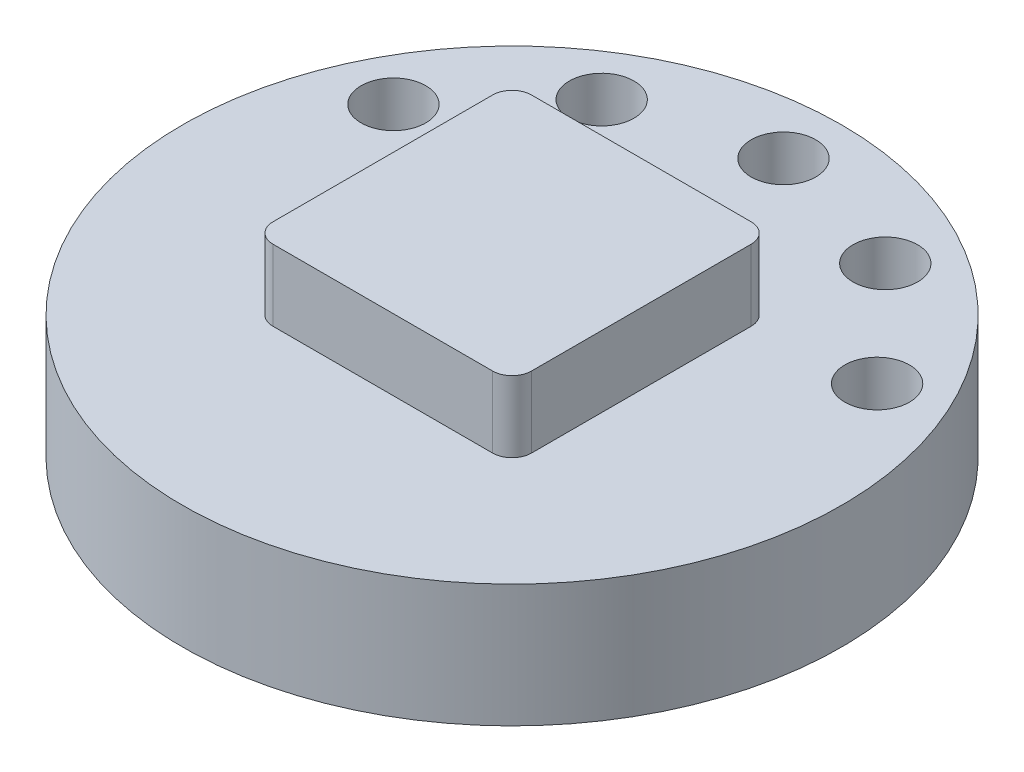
ISO-10303-21;
HEADER;
FILE_DESCRIPTION(('STEP AP214'),'2;1');
FILE_NAME('part.step','',(''),(''),'','','');
FILE_SCHEMA(('AUTOMOTIVE_DESIGN { 1 0 10303 214 1 1 1 1 }'));
ENDSEC;
DATA;
#1=APPLICATION_CONTEXT('core data for automotive mechanical design processes');
#2=APPLICATION_PROTOCOL_DEFINITION('international standard','automotive_design',2000,#1);
#3=PRODUCT_CONTEXT('',#1,'mechanical');
#4=PRODUCT('Part','Part','',(#3));
#5=PRODUCT_RELATED_PRODUCT_CATEGORY('part','',(#4));
#6=PRODUCT_DEFINITION_FORMATION('','',#4);
#7=PRODUCT_DEFINITION_CONTEXT('part definition',#1,'design');
#8=PRODUCT_DEFINITION('design','',#6,#7);
#9=PRODUCT_DEFINITION_SHAPE('','',#8);
#10=(LENGTH_UNIT() NAMED_UNIT(*) SI_UNIT(.MILLI.,.METRE.));
#11=(NAMED_UNIT(*) PLANE_ANGLE_UNIT() SI_UNIT($,.RADIAN.));
#12=(NAMED_UNIT(*) SI_UNIT($,.STERADIAN.) SOLID_ANGLE_UNIT());
#13=UNCERTAINTY_MEASURE_WITH_UNIT(LENGTH_MEASURE(1.E-05),#10,'distance_accuracy_value','');
#14=(GEOMETRIC_REPRESENTATION_CONTEXT(3) GLOBAL_UNCERTAINTY_ASSIGNED_CONTEXT((#13)) GLOBAL_UNIT_ASSIGNED_CONTEXT((#10,
#11,#12)) REPRESENTATION_CONTEXT('',''));
#15=CARTESIAN_POINT('',(0.,0.,0.));
#16=DIRECTION('',(0.,0.,1.));
#17=DIRECTION('',(1.,0.,0.));
#18=AXIS2_PLACEMENT_3D('',#15,#16,#17);
#19=CARTESIAN_POINT('',(0.,1.9,0.));
#20=DIRECTION('',(0.,1.,0.));
#21=DIRECTION('',(0.,0.,1.));
#22=AXIS2_PLACEMENT_3D('',#19,#20,#21);
#23=PLANE('',#22);
#24=CARTESIAN_POINT('',(-3.74222740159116,1.9,-1.90676009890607));
#25=DIRECTION('',(0.,1.,0.));
#26=DIRECTION('',(0.,0.,-1.));
#27=AXIS2_PLACEMENT_3D('',#24,#25,#26);
#28=CIRCLE('',#27,0.5);
#29=CARTESIAN_POINT('',(-3.74222740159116,1.9,-2.40676009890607));
#30=VERTEX_POINT('',#29);
#31=EDGE_CURVE('E141',#30,#30,#28,.T.);
#32=ORIENTED_EDGE('',*,*,#31,.F.);
#33=EDGE_LOOP('',(#32));
#34=FACE_BOUND('',#33,.T.);
#35=CARTESIAN_POINT('',(2.194493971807,1.9,-3.58108869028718));
#36=DIRECTION('',(0.,1.,0.));
#37=DIRECTION('',(0.,0.,1.));
#38=AXIS2_PLACEMENT_3D('',#35,#36,#37);
#39=CIRCLE('',#38,0.5);
#40=CARTESIAN_POINT('',(2.194493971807,1.9,-3.08108869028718));
#41=VERTEX_POINT('',#40);
#42=EDGE_CURVE('E153',#41,#41,#39,.T.);
#43=ORIENTED_EDGE('',*,*,#42,.F.);
#44=EDGE_LOOP('',(#43));
#45=FACE_BOUND('',#44,.T.);
#46=CARTESIAN_POINT('',(0.,1.9,0.));
#47=DIRECTION('',(0.,1.,0.));
#48=DIRECTION('',(0.,0.,1.));
#49=AXIS2_PLACEMENT_3D('',#46,#47,#48);
#50=CIRCLE('',#49,5.1);
#51=CARTESIAN_POINT('',(0.,1.9,-5.1));
#52=VERTEX_POINT('',#51);
#53=EDGE_CURVE('E165',#52,#52,#50,.T.);
#54=ORIENTED_EDGE('',*,*,#53,.T.);
#55=EDGE_LOOP('',(#54));
#56=FACE_BOUND('',#55,.T.);
#57=CARTESIAN_POINT('',(0.,1.9,-4.2));
#58=DIRECTION('',(0.,1.,0.));
#59=DIRECTION('',(0.,0.,1.));
#60=AXIS2_PLACEMENT_3D('',#57,#58,#59);
#61=CIRCLE('',#60,0.5);
#62=CARTESIAN_POINT('',(0.,1.9,-3.7));
#63=VERTEX_POINT('',#62);
#64=EDGE_CURVE('E159',#63,#63,#61,.T.);
#65=ORIENTED_EDGE('',*,*,#64,.F.);
#66=EDGE_LOOP('',(#65));
#67=FACE_BOUND('',#66,.T.);
#68=CARTESIAN_POINT('',(3.74222740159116,1.9,-1.90676009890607));
#69=DIRECTION('',(0.,1.,0.));
#70=DIRECTION('',(0.,0.,1.));
#71=AXIS2_PLACEMENT_3D('',#68,#69,#70);
#72=CIRCLE('',#71,0.5);
#73=CARTESIAN_POINT('',(3.74222740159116,1.9,-1.40676009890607));
#74=VERTEX_POINT('',#73);
#75=EDGE_CURVE('E147',#74,#74,#72,.T.);
#76=ORIENTED_EDGE('',*,*,#75,.F.);
#77=EDGE_LOOP('',(#76));
#78=FACE_BOUND('',#77,.T.);
#79=CARTESIAN_POINT('',(-2.194493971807,1.9,-3.58108869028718));
#80=DIRECTION('',(0.,1.,0.));
#81=DIRECTION('',(0.,0.,-1.));
#82=AXIS2_PLACEMENT_3D('',#79,#80,#81);
#83=CIRCLE('',#82,0.5);
#84=CARTESIAN_POINT('',(-2.194493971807,1.9,-4.08108869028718));
#85=VERTEX_POINT('',#84);
#86=EDGE_CURVE('E134',#85,#85,#83,.T.);
#87=ORIENTED_EDGE('',*,*,#86,.F.);
#88=EDGE_LOOP('',(#87));
#89=FACE_BOUND('',#88,.T.);
#90=DIRECTION('',(-1.,0.,0.));
#91=VECTOR('',#90,1.);
#92=CARTESIAN_POINT('',(-2.,1.9,-2.));
#93=LINE('',#92,#91);
#94=CARTESIAN_POINT('',(1.7,1.9,-2.));
#95=VERTEX_POINT('',#94);
#96=CARTESIAN_POINT('',(-1.7,1.9,-2.));
#97=VERTEX_POINT('',#96);
#98=EDGE_CURVE('E130',#95,#97,#93,.T.);
#99=ORIENTED_EDGE('',*,*,#98,.F.);
#100=CARTESIAN_POINT('',(1.7,1.9,-1.7));
#101=DIRECTION('',(0.,1.,0.));
#102=DIRECTION('',(0.,0.,1.));
#103=AXIS2_PLACEMENT_3D('',#100,#101,#102);
#104=CIRCLE('',#103,0.3);
#105=CARTESIAN_POINT('',(2.,1.9,-1.7));
#106=VERTEX_POINT('',#105);
#107=EDGE_CURVE('E45',#95,#106,#104,.F.);
#108=ORIENTED_EDGE('',*,*,#107,.T.);
#109=DIRECTION('',(0.,0.,-1.));
#110=VECTOR('',#109,1.);
#111=CARTESIAN_POINT('',(2.,1.9,2.));
#112=LINE('',#111,#110);
#113=CARTESIAN_POINT('',(2.,1.9,1.7));
#114=VERTEX_POINT('',#113);
#115=EDGE_CURVE('E191',#114,#106,#112,.T.);
#116=ORIENTED_EDGE('',*,*,#115,.F.);
#117=CARTESIAN_POINT('',(1.7,1.9,1.7));
#118=DIRECTION('',(0.,1.,0.));
#119=DIRECTION('',(0.,0.,1.));
#120=AXIS2_PLACEMENT_3D('',#117,#118,#119);
#121=CIRCLE('',#120,0.3);
#122=CARTESIAN_POINT('',(1.7,1.9,2.));
#123=VERTEX_POINT('',#122);
#124=EDGE_CURVE('E109',#114,#123,#121,.F.);
#125=ORIENTED_EDGE('',*,*,#124,.T.);
#126=DIRECTION('',(1.,0.,0.));
#127=VECTOR('',#126,1.);
#128=CARTESIAN_POINT('',(-2.,1.9,2.));
#129=LINE('',#128,#127);
#130=CARTESIAN_POINT('',(-1.7,1.9,2.));
#131=VERTEX_POINT('',#130);
#132=EDGE_CURVE('E116',#131,#123,#129,.T.);
#133=ORIENTED_EDGE('',*,*,#132,.F.);
#134=CARTESIAN_POINT('',(-1.7,1.9,1.7));
#135=DIRECTION('',(0.,1.,0.));
#136=DIRECTION('',(0.,0.,1.));
#137=AXIS2_PLACEMENT_3D('',#134,#135,#136);
#138=CIRCLE('',#137,0.3);
#139=CARTESIAN_POINT('',(-2.,1.9,1.7));
#140=VERTEX_POINT('',#139);
#141=EDGE_CURVE('E101',#131,#140,#138,.F.);
#142=ORIENTED_EDGE('',*,*,#141,.T.);
#143=DIRECTION('',(0.,0.,1.));
#144=VECTOR('',#143,1.);
#145=CARTESIAN_POINT('',(-2.,1.9,2.));
#146=LINE('',#145,#144);
#147=CARTESIAN_POINT('',(-2.,1.9,-1.7));
#148=VERTEX_POINT('',#147);
#149=EDGE_CURVE('E125',#148,#140,#146,.T.);
#150=ORIENTED_EDGE('',*,*,#149,.F.);
#151=CARTESIAN_POINT('',(-1.7,1.9,-1.7));
#152=DIRECTION('',(0.,1.,0.));
#153=DIRECTION('',(0.,0.,1.));
#154=AXIS2_PLACEMENT_3D('',#151,#152,#153);
#155=CIRCLE('',#154,0.3);
#156=EDGE_CURVE('E11',#148,#97,#155,.F.);
#157=ORIENTED_EDGE('',*,*,#156,.T.);
#158=EDGE_LOOP('',(#99,#108,#116,#125,#133,#142,#150,#157));
#159=FACE_BOUND('',#158,.T.);
#160=ADVANCED_FACE('F37',(#34,#45,#56,#67,#78,#89,#159),#23,.T.);
#161=CARTESIAN_POINT('',(0.,0.,0.));
#162=DIRECTION('',(0.,1.,0.));
#163=DIRECTION('',(0.,0.,1.));
#164=AXIS2_PLACEMENT_3D('',#161,#162,#163);
#165=PLANE('',#164);
#166=CARTESIAN_POINT('',(0.,0.,0.));
#167=DIRECTION('',(0.,1.,0.));
#168=DIRECTION('',(0.,0.,1.));
#169=AXIS2_PLACEMENT_3D('',#166,#167,#168);
#170=CIRCLE('',#169,5.1);
#171=CARTESIAN_POINT('',(0.,0.,-5.1));
#172=VERTEX_POINT('',#171);
#173=EDGE_CURVE('E162',#172,#172,#170,.T.);
#174=ORIENTED_EDGE('',*,*,#173,.F.);
#175=EDGE_LOOP('',(#174));
#176=FACE_BOUND('',#175,.T.);
#177=CARTESIAN_POINT('',(0.,0.,-4.2));
#178=DIRECTION('',(0.,1.,0.));
#179=DIRECTION('',(0.,0.,1.));
#180=AXIS2_PLACEMENT_3D('',#177,#178,#179);
#181=CIRCLE('',#180,0.5);
#182=CARTESIAN_POINT('',(0.,0.,-3.7));
#183=VERTEX_POINT('',#182);
#184=EDGE_CURVE('E156',#183,#183,#181,.T.);
#185=ORIENTED_EDGE('',*,*,#184,.T.);
#186=EDGE_LOOP('',(#185));
#187=FACE_BOUND('',#186,.T.);
#188=CARTESIAN_POINT('',(2.194493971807,0.,-3.58108869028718));
#189=DIRECTION('',(0.,1.,0.));
#190=DIRECTION('',(0.,0.,1.));
#191=AXIS2_PLACEMENT_3D('',#188,#189,#190);
#192=CIRCLE('',#191,0.5);
#193=CARTESIAN_POINT('',(2.194493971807,0.,-3.08108869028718));
#194=VERTEX_POINT('',#193);
#195=EDGE_CURVE('E150',#194,#194,#192,.T.);
#196=ORIENTED_EDGE('',*,*,#195,.T.);
#197=EDGE_LOOP('',(#196));
#198=FACE_BOUND('',#197,.T.);
#199=CARTESIAN_POINT('',(3.74222740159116,0.,-1.90676009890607));
#200=DIRECTION('',(0.,1.,0.));
#201=DIRECTION('',(0.,0.,1.));
#202=AXIS2_PLACEMENT_3D('',#199,#200,#201);
#203=CIRCLE('',#202,0.5);
#204=CARTESIAN_POINT('',(3.74222740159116,0.,-1.40676009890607));
#205=VERTEX_POINT('',#204);
#206=EDGE_CURVE('E144',#205,#205,#203,.T.);
#207=ORIENTED_EDGE('',*,*,#206,.T.);
#208=EDGE_LOOP('',(#207));
#209=FACE_BOUND('',#208,.T.);
#210=CARTESIAN_POINT('',(-3.74222740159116,0.,-1.90676009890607));
#211=DIRECTION('',(0.,1.,0.));
#212=DIRECTION('',(0.,0.,-1.));
#213=AXIS2_PLACEMENT_3D('',#210,#211,#212);
#214=CIRCLE('',#213,0.5);
#215=CARTESIAN_POINT('',(-3.74222740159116,0.,-2.40676009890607));
#216=VERTEX_POINT('',#215);
#217=EDGE_CURVE('E137',#216,#216,#214,.T.);
#218=ORIENTED_EDGE('',*,*,#217,.T.);
#219=EDGE_LOOP('',(#218));
#220=FACE_BOUND('',#219,.T.);
#221=CARTESIAN_POINT('',(-2.194493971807,0.,-3.58108869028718));
#222=DIRECTION('',(0.,1.,0.));
#223=DIRECTION('',(0.,0.,-1.));
#224=AXIS2_PLACEMENT_3D('',#221,#222,#223);
#225=CIRCLE('',#224,0.5);
#226=CARTESIAN_POINT('',(-2.194493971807,0.,-4.08108869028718));
#227=VERTEX_POINT('',#226);
#228=EDGE_CURVE('E138',#227,#227,#225,.T.);
#229=ORIENTED_EDGE('',*,*,#228,.T.);
#230=EDGE_LOOP('',(#229));
#231=FACE_BOUND('',#230,.T.);
#232=ADVANCED_FACE('F226',(#176,#187,#198,#209,#220,#231),#165,.F.);
#233=CARTESIAN_POINT('',(0.,1.9,0.));
#234=DIRECTION('',(0.,-1.,0.));
#235=DIRECTION('',(0.,0.,-1.));
#236=AXIS2_PLACEMENT_3D('',#233,#234,#235);
#237=CYLINDRICAL_SURFACE('',#236,5.1);
#238=CARTESIAN_POINT('',(0.,1.9,-5.1));
#239=CARTESIAN_POINT('',(0.,1.88020833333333,-5.1));
#240=CARTESIAN_POINT('',(0.,1.86041666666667,-5.1));
#241=CARTESIAN_POINT('',(0.,1.82083333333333,-5.1));
#242=CARTESIAN_POINT('',(0.,1.80104166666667,-5.1));
#243=CARTESIAN_POINT('',(0.,1.76145833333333,-5.1));
#244=CARTESIAN_POINT('',(0.,1.74166666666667,-5.1));
#245=CARTESIAN_POINT('',(0.,1.70208333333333,-5.1));
#246=CARTESIAN_POINT('',(0.,1.68229166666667,-5.1));
#247=CARTESIAN_POINT('',(0.,1.64270833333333,-5.1));
#248=CARTESIAN_POINT('',(0.,1.62291666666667,-5.1));
#249=CARTESIAN_POINT('',(0.,1.58333333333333,-5.1));
#250=CARTESIAN_POINT('',(0.,1.56354166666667,-5.1));
#251=CARTESIAN_POINT('',(0.,1.52395833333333,-5.1));
#252=CARTESIAN_POINT('',(0.,1.50416666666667,-5.1));
#253=CARTESIAN_POINT('',(0.,1.46458333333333,-5.1));
#254=CARTESIAN_POINT('',(0.,1.44479166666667,-5.1));
#255=CARTESIAN_POINT('',(0.,1.40520833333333,-5.1));
#256=CARTESIAN_POINT('',(0.,1.38541666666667,-5.1));
#257=CARTESIAN_POINT('',(0.,1.34583333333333,-5.1));
#258=CARTESIAN_POINT('',(0.,1.32604166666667,-5.1));
#259=CARTESIAN_POINT('',(0.,1.28645833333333,-5.1));
#260=CARTESIAN_POINT('',(0.,1.26666666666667,-5.1));
#261=CARTESIAN_POINT('',(0.,1.22708333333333,-5.1));
#262=CARTESIAN_POINT('',(0.,1.20729166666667,-5.1));
#263=CARTESIAN_POINT('',(0.,1.16770833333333,-5.1));
#264=CARTESIAN_POINT('',(0.,1.14791666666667,-5.1));
#265=CARTESIAN_POINT('',(0.,1.10833333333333,-5.1));
#266=CARTESIAN_POINT('',(0.,1.08854166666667,-5.1));
#267=CARTESIAN_POINT('',(0.,1.04895833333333,-5.1));
#268=CARTESIAN_POINT('',(0.,1.02916666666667,-5.1));
#269=CARTESIAN_POINT('',(0.,0.989583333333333,-5.1));
#270=CARTESIAN_POINT('',(0.,0.969791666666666,-5.1));
#271=CARTESIAN_POINT('',(0.,0.930208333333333,-5.1));
#272=CARTESIAN_POINT('',(0.,0.910416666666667,-5.1));
#273=CARTESIAN_POINT('',(0.,0.870833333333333,-5.1));
#274=CARTESIAN_POINT('',(0.,0.851041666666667,-5.1));
#275=CARTESIAN_POINT('',(0.,0.811458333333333,-5.1));
#276=CARTESIAN_POINT('',(0.,0.791666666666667,-5.1));
#277=CARTESIAN_POINT('',(0.,0.752083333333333,-5.1));
#278=CARTESIAN_POINT('',(0.,0.732291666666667,-5.1));
#279=CARTESIAN_POINT('',(0.,0.692708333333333,-5.1));
#280=CARTESIAN_POINT('',(0.,0.672916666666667,-5.1));
#281=CARTESIAN_POINT('',(0.,0.633333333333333,-5.1));
#282=CARTESIAN_POINT('',(0.,0.613541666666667,-5.1));
#283=CARTESIAN_POINT('',(0.,0.573958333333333,-5.1));
#284=CARTESIAN_POINT('',(0.,0.554166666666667,-5.1));
#285=CARTESIAN_POINT('',(0.,0.514583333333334,-5.1));
#286=CARTESIAN_POINT('',(0.,0.494791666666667,-5.1));
#287=CARTESIAN_POINT('',(0.,0.455208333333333,-5.1));
#288=CARTESIAN_POINT('',(0.,0.435416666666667,-5.1));
#289=CARTESIAN_POINT('',(0.,0.395833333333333,-5.1));
#290=CARTESIAN_POINT('',(0.,0.376041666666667,-5.1));
#291=CARTESIAN_POINT('',(0.,0.336458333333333,-5.1));
#292=CARTESIAN_POINT('',(0.,0.316666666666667,-5.1));
#293=CARTESIAN_POINT('',(0.,0.277083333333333,-5.1));
#294=CARTESIAN_POINT('',(0.,0.257291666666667,-5.1));
#295=CARTESIAN_POINT('',(0.,0.217708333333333,-5.1));
#296=CARTESIAN_POINT('',(0.,0.197916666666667,-5.1));
#297=CARTESIAN_POINT('',(0.,0.158333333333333,-5.1));
#298=CARTESIAN_POINT('',(0.,0.138541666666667,-5.1));
#299=CARTESIAN_POINT('',(0.,0.0989583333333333,-5.1));
#300=CARTESIAN_POINT('',(0.,0.0791666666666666,-5.1));
#301=CARTESIAN_POINT('',(0.,0.0395833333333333,-5.1));
#302=CARTESIAN_POINT('',(0.,0.0197916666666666,-5.1));
#303=CARTESIAN_POINT('',(0.,0.,-5.1));
#304=B_SPLINE_CURVE_WITH_KNOTS('',3,(#238,#239,#240,#241,#242,#243,#244,#245,#246,#247,#248,
#249,#250,#251,#252,#253,#254,#255,#256,#257,#258,#259,#260,#261,#262,#263,#264,#265,#266,#267,
#268,#269,#270,#271,#272,#273,#274,#275,#276,#277,#278,#279,#280,#281,#282,#283,#284,#285,#286,
#287,#288,#289,#290,#291,#292,#293,#294,#295,#296,#297,#298,#299,#300,#301,#302,#303),
.UNSPECIFIED.,.F.,.F.,(4,2,2,2,2,2,2,2,2,2,2,2,2,2,2,2,2,2,2,2,2,2,2,2,2,2,2,2,2,2,2,2,4),(0.,
0.0593750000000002,0.11875,0.178125,0.2375,0.296875,0.35625,0.415625,0.475,0.534375,0.59375,
0.653125,0.7125,0.771875,0.83125,0.890625,0.95,1.009375,1.06875,1.128125,1.1875,1.246875,
1.30625,1.365625,1.425,1.484375,1.54375,1.603125,1.6625,1.721875,1.78125,1.840625,1.9),.UNSPECIFIED.);
#305=EDGE_CURVE('BSEAM234',#52,#172,#304,.T.);
#306=ORIENTED_EDGE('',*,*,#53,.F.);
#307=ORIENTED_EDGE('',*,*,#173,.T.);
#308=ORIENTED_EDGE('',*,*,#305,.T.);
#309=ORIENTED_EDGE('',*,*,#305,.F.);
#310=EDGE_LOOP('',(#306,#308,#307,#309));
#311=FACE_BOUND('',#310,.T.);
#312=ADVANCED_FACE('F234',(#311),#237,.T.);
#313=CARTESIAN_POINT('',(0.,1.9,-4.2));
#314=DIRECTION('',(0.,-1.,0.));
#315=DIRECTION('',(0.,0.,-1.));
#316=AXIS2_PLACEMENT_3D('',#313,#314,#315);
#317=CYLINDRICAL_SURFACE('',#316,0.5);
#318=ORIENTED_EDGE('',*,*,#64,.T.);
#319=EDGE_LOOP('',(#318));
#320=FACE_BOUND('',#319,.T.);
#321=ORIENTED_EDGE('',*,*,#184,.F.);
#322=EDGE_LOOP('',(#321));
#323=FACE_BOUND('',#322,.T.);
#324=ADVANCED_FACE('F240',(#320,#323),#317,.F.);
#325=CARTESIAN_POINT('',(2.194493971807,1.9,-3.58108869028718));
#326=DIRECTION('',(0.,-1.,0.));
#327=DIRECTION('',(0.,0.,-1.));
#328=AXIS2_PLACEMENT_3D('',#325,#326,#327);
#329=CYLINDRICAL_SURFACE('',#328,0.5);
#330=ORIENTED_EDGE('',*,*,#42,.T.);
#331=EDGE_LOOP('',(#330));
#332=FACE_BOUND('',#331,.T.);
#333=ORIENTED_EDGE('',*,*,#195,.F.);
#334=EDGE_LOOP('',(#333));
#335=FACE_BOUND('',#334,.T.);
#336=ADVANCED_FACE('F329',(#332,#335),#329,.F.);
#337=CARTESIAN_POINT('',(3.74222740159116,1.9,-1.90676009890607));
#338=DIRECTION('',(0.,-1.,0.));
#339=DIRECTION('',(0.,0.,-1.));
#340=AXIS2_PLACEMENT_3D('',#337,#338,#339);
#341=CYLINDRICAL_SURFACE('',#340,0.5);
#342=ORIENTED_EDGE('',*,*,#75,.T.);
#343=EDGE_LOOP('',(#342));
#344=FACE_BOUND('',#343,.T.);
#345=ORIENTED_EDGE('',*,*,#206,.F.);
#346=EDGE_LOOP('',(#345));
#347=FACE_BOUND('',#346,.T.);
#348=ADVANCED_FACE('F321',(#344,#347),#341,.F.);
#349=CARTESIAN_POINT('',(-3.74222740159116,1.9,-1.90676009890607));
#350=DIRECTION('',(0.,-1.,0.));
#351=DIRECTION('',(0.,0.,-1.));
#352=AXIS2_PLACEMENT_3D('',#349,#350,#351);
#353=CYLINDRICAL_SURFACE('',#352,0.5);
#354=ORIENTED_EDGE('',*,*,#31,.T.);
#355=EDGE_LOOP('',(#354));
#356=FACE_BOUND('',#355,.T.);
#357=ORIENTED_EDGE('',*,*,#217,.F.);
#358=EDGE_LOOP('',(#357));
#359=FACE_BOUND('',#358,.T.);
#360=ADVANCED_FACE('F313',(#356,#359),#353,.F.);
#361=CARTESIAN_POINT('',(-2.194493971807,1.9,-3.58108869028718));
#362=DIRECTION('',(0.,-1.,0.));
#363=DIRECTION('',(0.,0.,-1.));
#364=AXIS2_PLACEMENT_3D('',#361,#362,#363);
#365=CYLINDRICAL_SURFACE('',#364,0.5);
#366=ORIENTED_EDGE('',*,*,#86,.T.);
#367=EDGE_LOOP('',(#366));
#368=FACE_BOUND('',#367,.T.);
#369=ORIENTED_EDGE('',*,*,#228,.F.);
#370=EDGE_LOOP('',(#369));
#371=FACE_BOUND('',#370,.T.);
#372=ADVANCED_FACE('F305',(#368,#371),#365,.F.);
#373=CARTESIAN_POINT('',(2.,3.,2.));
#374=DIRECTION('',(-1.,0.,0.));
#375=DIRECTION('',(0.,0.,1.));
#376=AXIS2_PLACEMENT_3D('',#373,#374,#375);
#377=PLANE('',#376);
#378=DIRECTION('',(0.,0.,-1.));
#379=VECTOR('',#378,1.);
#380=CARTESIAN_POINT('',(2.,3.,2.));
#381=LINE('',#380,#379);
#382=CARTESIAN_POINT('',(2.,3.,1.7));
#383=VERTEX_POINT('',#382);
#384=CARTESIAN_POINT('',(2.,3.,-1.7));
#385=VERTEX_POINT('',#384);
#386=EDGE_CURVE('E124',#383,#385,#381,.T.);
#387=ORIENTED_EDGE('',*,*,#386,.F.);
#388=DIRECTION('',(0.,-1.,0.));
#389=VECTOR('',#388,1.);
#390=CARTESIAN_POINT('',(2.,3.,1.7));
#391=LINE('',#390,#389);
#392=EDGE_CURVE('E184',#383,#114,#391,.T.);
#393=ORIENTED_EDGE('',*,*,#392,.T.);
#394=ORIENTED_EDGE('',*,*,#115,.T.);
#395=DIRECTION('',(0.,-1.,0.));
#396=VECTOR('',#395,1.);
#397=CARTESIAN_POINT('',(2.,3.,-1.7));
#398=LINE('',#397,#396);
#399=EDGE_CURVE('E182',#106,#385,#398,.F.);
#400=ORIENTED_EDGE('',*,*,#399,.T.);
#401=EDGE_LOOP('',(#387,#393,#394,#400));
#402=FACE_BOUND('',#401,.T.);
#403=ADVANCED_FACE('F194',(#402),#377,.F.);
#404=CARTESIAN_POINT('',(-2.,3.,-2.));
#405=DIRECTION('',(0.,0.,1.));
#406=DIRECTION('',(1.,0.,0.));
#407=AXIS2_PLACEMENT_3D('',#404,#405,#406);
#408=PLANE('',#407);
#409=DIRECTION('',(-1.,0.,0.));
#410=VECTOR('',#409,1.);
#411=CARTESIAN_POINT('',(-2.,3.,-2.));
#412=LINE('',#411,#410);
#413=CARTESIAN_POINT('',(1.7,3.,-2.));
#414=VERTEX_POINT('',#413);
#415=CARTESIAN_POINT('',(-1.7,3.,-2.));
#416=VERTEX_POINT('',#415);
#417=EDGE_CURVE('E128',#414,#416,#412,.T.);
#418=ORIENTED_EDGE('',*,*,#417,.F.);
#419=DIRECTION('',(0.,-1.,0.));
#420=VECTOR('',#419,1.);
#421=CARTESIAN_POINT('',(1.7,3.,-2.));
#422=LINE('',#421,#420);
#423=EDGE_CURVE('E110',#414,#95,#422,.T.);
#424=ORIENTED_EDGE('',*,*,#423,.T.);
#425=ORIENTED_EDGE('',*,*,#98,.T.);
#426=DIRECTION('',(0.,-1.,0.));
#427=VECTOR('',#426,1.);
#428=CARTESIAN_POINT('',(-1.7,3.,-2.));
#429=LINE('',#428,#427);
#430=EDGE_CURVE('E187',#97,#416,#429,.F.);
#431=ORIENTED_EDGE('',*,*,#430,.T.);
#432=EDGE_LOOP('',(#418,#424,#425,#431));
#433=FACE_BOUND('',#432,.T.);
#434=ADVANCED_FACE('F206',(#433),#408,.F.);
#435=CARTESIAN_POINT('',(-2.,3.,2.));
#436=DIRECTION('',(1.,0.,0.));
#437=DIRECTION('',(0.,0.,-1.));
#438=AXIS2_PLACEMENT_3D('',#435,#436,#437);
#439=PLANE('',#438);
#440=ORIENTED_EDGE('',*,*,#149,.T.);
#441=DIRECTION('',(0.,-1.,0.));
#442=VECTOR('',#441,1.);
#443=CARTESIAN_POINT('',(-2.,3.,1.7));
#444=LINE('',#443,#442);
#445=CARTESIAN_POINT('',(-2.,3.,1.7));
#446=VERTEX_POINT('',#445);
#447=EDGE_CURVE('E106',#140,#446,#444,.F.);
#448=ORIENTED_EDGE('',*,*,#447,.T.);
#449=DIRECTION('',(0.,0.,1.));
#450=VECTOR('',#449,1.);
#451=CARTESIAN_POINT('',(-2.,3.,2.));
#452=LINE('',#451,#450);
#453=CARTESIAN_POINT('',(-2.,3.,-1.7));
#454=VERTEX_POINT('',#453);
#455=EDGE_CURVE('E208',#454,#446,#452,.T.);
#456=ORIENTED_EDGE('',*,*,#455,.F.);
#457=DIRECTION('',(0.,-1.,0.));
#458=VECTOR('',#457,1.);
#459=CARTESIAN_POINT('',(-2.,3.,-1.7));
#460=LINE('',#459,#458);
#461=EDGE_CURVE('E120',#454,#148,#460,.T.);
#462=ORIENTED_EDGE('',*,*,#461,.T.);
#463=EDGE_LOOP('',(#440,#448,#456,#462));
#464=FACE_BOUND('',#463,.T.);
#465=ADVANCED_FACE('F216',(#464),#439,.F.);
#466=CARTESIAN_POINT('',(-2.,3.,2.));
#467=DIRECTION('',(0.,0.,-1.));
#468=DIRECTION('',(-1.,0.,0.));
#469=AXIS2_PLACEMENT_3D('',#466,#467,#468);
#470=PLANE('',#469);
#471=DIRECTION('',(1.,0.,0.));
#472=VECTOR('',#471,1.);
#473=CARTESIAN_POINT('',(-2.,3.,2.));
#474=LINE('',#473,#472);
#475=CARTESIAN_POINT('',(-1.7,3.,2.));
#476=VERTEX_POINT('',#475);
#477=CARTESIAN_POINT('',(1.7,3.,2.));
#478=VERTEX_POINT('',#477);
#479=EDGE_CURVE('E119',#476,#478,#474,.T.);
#480=ORIENTED_EDGE('',*,*,#479,.F.);
#481=DIRECTION('',(0.,-1.,0.));
#482=VECTOR('',#481,1.);
#483=CARTESIAN_POINT('',(-1.7,3.,2.));
#484=LINE('',#483,#482);
#485=EDGE_CURVE('E105',#476,#131,#484,.T.);
#486=ORIENTED_EDGE('',*,*,#485,.T.);
#487=ORIENTED_EDGE('',*,*,#132,.T.);
#488=DIRECTION('',(0.,-1.,0.));
#489=VECTOR('',#488,1.);
#490=CARTESIAN_POINT('',(1.7,3.,2.));
#491=LINE('',#490,#489);
#492=EDGE_CURVE('E121',#123,#478,#491,.F.);
#493=ORIENTED_EDGE('',*,*,#492,.T.);
#494=EDGE_LOOP('',(#480,#486,#487,#493));
#495=FACE_BOUND('',#494,.T.);
#496=ADVANCED_FACE('F115',(#495),#470,.F.);
#497=CARTESIAN_POINT('',(0.,3.,0.));
#498=DIRECTION('',(0.,-1.,0.));
#499=DIRECTION('',(0.,0.,-1.));
#500=AXIS2_PLACEMENT_3D('',#497,#498,#499);
#501=PLANE('',#500);
#502=ORIENTED_EDGE('',*,*,#455,.T.);
#503=CARTESIAN_POINT('',(-1.7,3.,1.7));
#504=DIRECTION('',(0.,-1.,0.));
#505=DIRECTION('',(0.,0.,-1.));
#506=AXIS2_PLACEMENT_3D('',#503,#504,#505);
#507=CIRCLE('',#506,0.3);
#508=EDGE_CURVE('E180',#446,#476,#507,.F.);
#509=ORIENTED_EDGE('',*,*,#508,.T.);
#510=ORIENTED_EDGE('',*,*,#479,.T.);
#511=CARTESIAN_POINT('',(1.7,3.,1.7));
#512=DIRECTION('',(0.,-1.,0.));
#513=DIRECTION('',(0.,0.,-1.));
#514=AXIS2_PLACEMENT_3D('',#511,#512,#513);
#515=CIRCLE('',#514,0.3);
#516=EDGE_CURVE('E178',#478,#383,#515,.F.);
#517=ORIENTED_EDGE('',*,*,#516,.T.);
#518=ORIENTED_EDGE('',*,*,#386,.T.);
#519=CARTESIAN_POINT('',(1.7,3.,-1.7));
#520=DIRECTION('',(0.,-1.,0.));
#521=DIRECTION('',(0.,0.,-1.));
#522=AXIS2_PLACEMENT_3D('',#519,#520,#521);
#523=CIRCLE('',#522,0.3);
#524=EDGE_CURVE('E176',#385,#414,#523,.F.);
#525=ORIENTED_EDGE('',*,*,#524,.T.);
#526=ORIENTED_EDGE('',*,*,#417,.T.);
#527=CARTESIAN_POINT('',(-1.7,3.,-1.7));
#528=DIRECTION('',(0.,-1.,0.));
#529=DIRECTION('',(0.,0.,-1.));
#530=AXIS2_PLACEMENT_3D('',#527,#528,#529);
#531=CIRCLE('',#530,0.3);
#532=EDGE_CURVE('E174',#416,#454,#531,.F.);
#533=ORIENTED_EDGE('',*,*,#532,.T.);
#534=EDGE_LOOP('',(#502,#509,#510,#517,#518,#525,#526,#533));
#535=FACE_BOUND('',#534,.T.);
#536=ADVANCED_FACE('F203',(#535),#501,.F.);
#537=CARTESIAN_POINT('',(-1.7,3.,1.7));
#538=DIRECTION('',(0.,-1.,0.));
#539=DIRECTION('',(0.,0.,-1.));
#540=AXIS2_PLACEMENT_3D('',#537,#538,#539);
#541=CYLINDRICAL_SURFACE('',#540,0.3);
#542=ORIENTED_EDGE('',*,*,#508,.F.);
#543=ORIENTED_EDGE('',*,*,#447,.F.);
#544=ORIENTED_EDGE('',*,*,#141,.F.);
#545=ORIENTED_EDGE('',*,*,#485,.F.);
#546=EDGE_LOOP('',(#542,#543,#544,#545));
#547=FACE_BOUND('',#546,.T.);
#548=ADVANCED_FACE('F104',(#547),#541,.T.);
#549=CARTESIAN_POINT('',(1.7,3.,1.7));
#550=DIRECTION('',(0.,-1.,0.));
#551=DIRECTION('',(0.,0.,-1.));
#552=AXIS2_PLACEMENT_3D('',#549,#550,#551);
#553=CYLINDRICAL_SURFACE('',#552,0.3);
#554=ORIENTED_EDGE('',*,*,#516,.F.);
#555=ORIENTED_EDGE('',*,*,#492,.F.);
#556=ORIENTED_EDGE('',*,*,#124,.F.);
#557=ORIENTED_EDGE('',*,*,#392,.F.);
#558=EDGE_LOOP('',(#554,#555,#556,#557));
#559=FACE_BOUND('',#558,.T.);
#560=ADVANCED_FACE('F248',(#559),#553,.T.);
#561=CARTESIAN_POINT('',(1.7,3.,-1.7));
#562=DIRECTION('',(0.,-1.,0.));
#563=DIRECTION('',(0.,0.,-1.));
#564=AXIS2_PLACEMENT_3D('',#561,#562,#563);
#565=CYLINDRICAL_SURFACE('',#564,0.3);
#566=ORIENTED_EDGE('',*,*,#524,.F.);
#567=ORIENTED_EDGE('',*,*,#399,.F.);
#568=ORIENTED_EDGE('',*,*,#107,.F.);
#569=ORIENTED_EDGE('',*,*,#423,.F.);
#570=EDGE_LOOP('',(#566,#567,#568,#569));
#571=FACE_BOUND('',#570,.T.);
#572=ADVANCED_FACE('F198',(#571),#565,.T.);
#573=CARTESIAN_POINT('',(-1.7,3.,-1.7));
#574=DIRECTION('',(0.,-1.,0.));
#575=DIRECTION('',(0.,0.,-1.));
#576=AXIS2_PLACEMENT_3D('',#573,#574,#575);
#577=CYLINDRICAL_SURFACE('',#576,0.3);
#578=ORIENTED_EDGE('',*,*,#532,.F.);
#579=ORIENTED_EDGE('',*,*,#430,.F.);
#580=ORIENTED_EDGE('',*,*,#156,.F.);
#581=ORIENTED_EDGE('',*,*,#461,.F.);
#582=EDGE_LOOP('',(#578,#579,#580,#581));
#583=FACE_BOUND('',#582,.T.);
#584=ADVANCED_FACE('F39',(#583),#577,.T.);
#585=CLOSED_SHELL('',(#160,#232,#312,#324,#336,#348,#360,#372,#403,#434,#465,#496,#536,#548,
#560,#572,#584));
#586=MANIFOLD_SOLID_BREP('B2',#585);
#587=ADVANCED_BREP_SHAPE_REPRESENTATION('',(#18,#586),#14);
#588=SHAPE_DEFINITION_REPRESENTATION(#9,#587);
ENDSEC;
END-ISO-10303-21;
